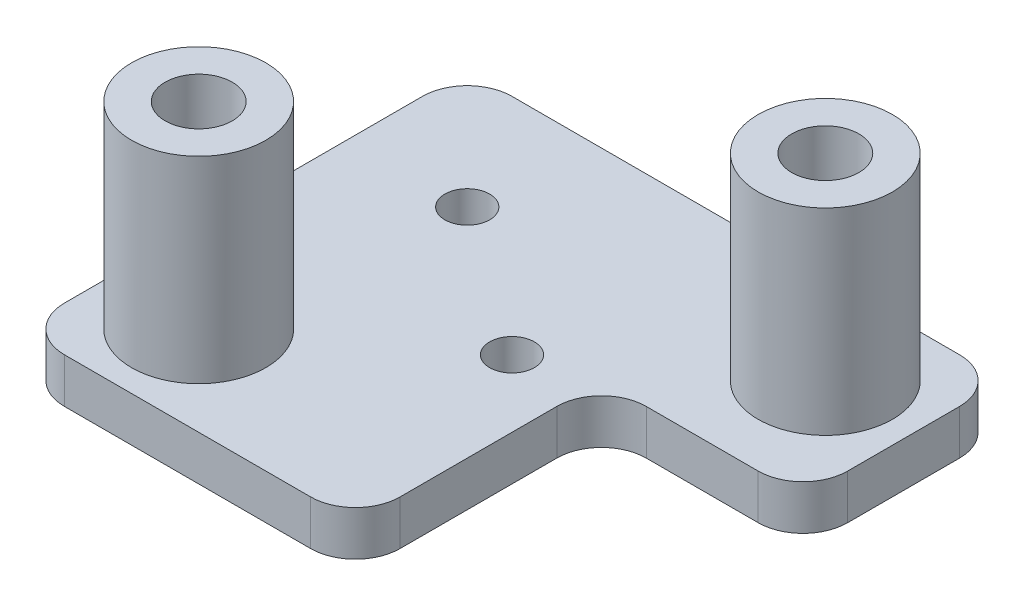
from build123d import *

# Parameters (mm, degrees)
CROQUIS1_R                = 1.5
SALIENTE_EXTRUIR1_DEPTH   = 1
CROQUIS2_R                = 1.5
SALIENTE_EXTRUIR2_DEPTH   = 4.4
SALIENTE_EXTRUIR2_2_DEPTH = 4.4
CROQUIS3_R                = 0.75
CORTAR_EXTRUIR1_DEPTH     = 8
REDONDEO1_R               = 1
SALIENTE_EXTRUIR3_START   = 1
CROQUIS4_R                = 1.5
CROQUIS4_R_2              = 0.75
SALIENTE_EXTRUIR3_DEPTH   = 1
CROQUIS5_R                = 0.5
CORTAR_EXTRUIR2_DEPTH     = 1


with BuildPart() as part:
    # Croquis1 → Saliente-Extruir1 (new body)
    with BuildSketch(Plane(origin=(0, 0, 0), x_dir=(1, 0, 0), z_dir=(0, 1, 0))):
        Polygon((-6, 5), (6, 5), (6, 0.5), (1.5, 0.5), (1.5, -5), (-6, -5), align=None)
        with Locations(Location((4, 3, 0), (0, 0, 270))):
            Circle(CROQUIS1_R, mode=Mode.SUBTRACT)
        with Locations(Location((-4, -3, 0), (0, 0, 270))):
            Circle(CROQUIS1_R, mode=Mode.SUBTRACT)
    extrude(amount=SALIENTE_EXTRUIR1_DEPTH)

    # Redondeo1
    redondeo1_edges = [part.edges().sort_by_distance(p)[0] for p in [
        (-6, 0.5, -5),
        (6, 0.5, -5),
        (6, 0.5, -0.5),
        (1.5, 0.5, -0.5),
        (1.5, 0.5, 5),
        (-6, 0.5, 5),
    ]]
    fillet(redondeo1_edges, radius=REDONDEO1_R)

    # Croquis5 → Cortar-Extruir2 (cut)
    with BuildSketch(Plane(origin=(0, 1, 0), x_dir=(1, 0, 0), z_dir=(0, 1, 0))):
        with Locations(Location((-3.36, 2.36, 0), (0, 0, 270))):
            Circle(CROQUIS5_R)
        with Locations(Location((0, 0, 0), (0, 0, 270))):
            Circle(CROQUIS5_R)
    extrude(amount=-CORTAR_EXTRUIR2_DEPTH, mode=Mode.SUBTRACT)


with BuildPart() as body_2:
    # Croquis2 → Saliente-Extruir2 (new body)
    with BuildSketch(Plane(origin=(0, 1, 0), x_dir=(1, 0, 0), z_dir=(0, 1, 0))):
        with Locations(Location((4, 3, 0), (0, 0, 270))):
            Circle(CROQUIS2_R)
    extrude(amount=SALIENTE_EXTRUIR2_DEPTH)


with BuildPart() as body_3:
    # Croquis2 → Saliente-Extruir2 2 (new body)
    with BuildSketch(Plane(origin=(0, 1, 0), x_dir=(1, 0, 0), z_dir=(0, 1, 0))):
        with Locations(Location((-4, -3, 0), (0, 0, 270))):
            Circle(CROQUIS2_R)
    extrude(amount=SALIENTE_EXTRUIR2_2_DEPTH)


with BuildPart() as cortar_extruir1_tool:
    # Croquis3 → Cortar-Extruir1 (new body)
    with BuildSketch(Plane(origin=(0, 5.4, 0), x_dir=(1, 0, 0), z_dir=(0, 1, 0))):
        with Locations(Location((4, 3, 0), (0, 0, 270))):
            Circle(CROQUIS3_R)
        with Locations(Location((-4, -3, 0), (0, 0, 270))):
            Circle(CROQUIS3_R)
    extrude(amount=-CORTAR_EXTRUIR1_DEPTH)


with BuildPart() as body_2_1:
    add(body_2.part)

    # Cortar-Extruir1: cut by cortar_extruir1_tool
    add(cortar_extruir1_tool.part, mode=Mode.SUBTRACT)


with BuildPart() as body_3_1:
    add(body_3.part)

    # Cortar-Extruir1: cut by cortar_extruir1_tool
    add(cortar_extruir1_tool.part, mode=Mode.SUBTRACT)


    add(body_2_1.part)  # Saliente-Extruir3 merges body 2
    # Croquis4 → Saliente-Extruir3 (add)
    # profile 1 of 2: a face of its own
    with BuildSketch(Plane.XZ.offset(-1).offset(SALIENTE_EXTRUIR3_START)):
        with Locations(Location((4, -3, 0), (0, 0, 270))):
            Circle(CROQUIS4_R)
        with Locations(Location((4, -3, 0), (0, 0, 90))):
            Circle(CROQUIS4_R_2, mode=Mode.SUBTRACT)
    # profile 2 of 2: a face of its own
    with BuildSketch(Plane.XZ.offset(-1).offset(SALIENTE_EXTRUIR3_START)):
        with Locations(Location((-4, 3, 0), (0, 0, 270))):
            Circle(CROQUIS4_R)
        with Locations(Location((-4, 3, 0), (0, 0, 90))):
            Circle(CROQUIS4_R_2, mode=Mode.SUBTRACT)
    extrude(amount=-SALIENTE_EXTRUIR3_DEPTH)


solid = Compound([part.part, body_3_1.part])
